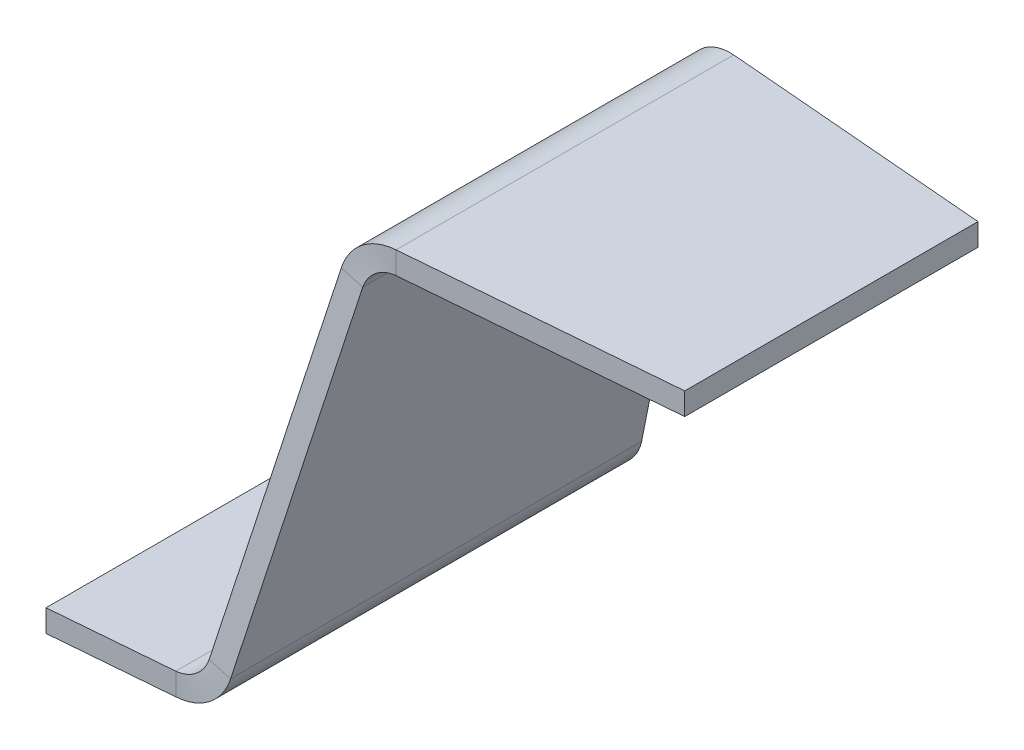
ISO-10303-21;
HEADER;
FILE_DESCRIPTION(('STEP AP214'),'2;1');
FILE_NAME('part.step','',(''),(''),'','','');
FILE_SCHEMA(('AUTOMOTIVE_DESIGN { 1 0 10303 214 1 1 1 1 }'));
ENDSEC;
DATA;
#1=APPLICATION_CONTEXT('core data for automotive mechanical design processes');
#2=APPLICATION_PROTOCOL_DEFINITION('international standard','automotive_design',2000,#1);
#3=PRODUCT_CONTEXT('',#1,'mechanical');
#4=PRODUCT('Part','Part','',(#3));
#5=PRODUCT_RELATED_PRODUCT_CATEGORY('part','',(#4));
#6=PRODUCT_DEFINITION_FORMATION('','',#4);
#7=PRODUCT_DEFINITION_CONTEXT('part definition',#1,'design');
#8=PRODUCT_DEFINITION('design','',#6,#7);
#9=PRODUCT_DEFINITION_SHAPE('','',#8);
#10=(LENGTH_UNIT() NAMED_UNIT(*) SI_UNIT(.MILLI.,.METRE.));
#11=(NAMED_UNIT(*) PLANE_ANGLE_UNIT() SI_UNIT($,.RADIAN.));
#12=(NAMED_UNIT(*) SI_UNIT($,.STERADIAN.) SOLID_ANGLE_UNIT());
#13=UNCERTAINTY_MEASURE_WITH_UNIT(LENGTH_MEASURE(1.E-05),#10,'distance_accuracy_value','');
#14=(GEOMETRIC_REPRESENTATION_CONTEXT(3) GLOBAL_UNCERTAINTY_ASSIGNED_CONTEXT((#13)) GLOBAL_UNIT_ASSIGNED_CONTEXT((#10,
#11,#12)) REPRESENTATION_CONTEXT('',''));
#15=CARTESIAN_POINT('',(0.,0.,0.));
#16=DIRECTION('',(0.,0.,1.));
#17=DIRECTION('',(1.,0.,0.));
#18=AXIS2_PLACEMENT_3D('',#15,#16,#17);
#19=CARTESIAN_POINT('',(21.3546614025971,-21.9803413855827,0.));
#20=DIRECTION('',(0.965925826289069,-0.258819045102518,0.));
#21=DIRECTION('',(0.,0.,-1.));
#22=AXIS2_PLACEMENT_3D('',#19,#20,#21);
#23=PLANE('',#22);
#24=DIRECTION('',(-0.257925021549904,-0.962589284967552,-0.0830454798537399));
#25=VECTOR('',#24,1.);
#26=CARTESIAN_POINT('',(21.3546614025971,-21.9803413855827,-37.5));
#27=LINE('',#26,#25);
#28=CARTESIAN_POINT('',(46.0544058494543,70.2003598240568,-29.5472929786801));
#29=VERTEX_POINT('',#28);
#30=CARTESIAN_POINT('',(29.0072975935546,6.57968569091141,-35.0360403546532));
#31=VERTEX_POINT('',#30);
#32=EDGE_CURVE('E89',#29,#31,#27,.T.);
#33=ORIENTED_EDGE('',*,*,#32,.F.);
#34=DIRECTION('',(0.,0.,1.));
#35=VECTOR('',#34,1.);
#36=CARTESIAN_POINT('',(46.0544058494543,70.2003598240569,0.));
#37=LINE('',#36,#35);
#38=CARTESIAN_POINT('',(46.0544058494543,70.2003598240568,29.5472929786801));
#39=VERTEX_POINT('',#38);
#40=EDGE_CURVE('E82',#29,#39,#37,.T.);
#41=ORIENTED_EDGE('',*,*,#40,.T.);
#42=DIRECTION('',(0.257925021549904,0.962589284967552,-0.08304547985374));
#43=VECTOR('',#42,1.);
#44=CARTESIAN_POINT('',(21.3546614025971,-21.9803413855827,37.5));
#45=LINE('',#44,#43);
#46=CARTESIAN_POINT('',(29.0072975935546,6.57968569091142,35.0360403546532));
#47=VERTEX_POINT('',#46);
#48=EDGE_CURVE('E97',#47,#39,#45,.T.);
#49=ORIENTED_EDGE('',*,*,#48,.F.);
#50=DIRECTION('',(0.,0.,-1.));
#51=VECTOR('',#50,1.);
#52=CARTESIAN_POINT('',(29.0072975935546,6.57968569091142,0.));
#53=LINE('',#52,#51);
#54=EDGE_CURVE('E547',#47,#31,#53,.T.);
#55=ORIENTED_EDGE('',*,*,#54,.T.);
#56=EDGE_LOOP('',(#33,#41,#49,#55));
#57=FACE_BOUND('',#56,.T.);
#58=ADVANCED_FACE('F70',(#57),#23,.T.);
#59=CARTESIAN_POINT('',(17.6867512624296,-20.9975278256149,37.5));
#60=DIRECTION('',(-0.0214937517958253,-0.080215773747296,-0.99654575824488));
#61=DIRECTION('',(-0.257925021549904,-0.962589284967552,0.08304547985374));
#62=AXIS2_PLACEMENT_3D('',#59,#60,#61);
#63=PLANE('',#62);
#64=CARTESIAN_POINT('',(42.3864957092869,71.1831733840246,29.5472929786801));
#65=CARTESIAN_POINT('',(46.0544058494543,70.2003598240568,29.5472929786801));
#66=B_SPLINE_CURVE_WITH_KNOTS('',1,(#64,#65),.UNSPECIFIED.,.F.,.F.,(2,2),(0.,1.),.UNSPECIFIED.);
#67=CARTESIAN_POINT('',(42.3864957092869,71.1831733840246,29.5472929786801));
#68=VERTEX_POINT('',#67);
#69=EDGE_CURVE('E852',#68,#39,#66,.T.);
#70=ORIENTED_EDGE('',*,*,#69,.F.);
#71=DIRECTION('',(0.257925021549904,0.962589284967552,-0.08304547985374));
#72=VECTOR('',#71,1.);
#73=CARTESIAN_POINT('',(17.6867512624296,-20.9975278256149,37.5));
#74=LINE('',#73,#72);
#75=CARTESIAN_POINT('',(25.3393874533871,7.56249925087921,35.0360403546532));
#76=VERTEX_POINT('',#75);
#77=EDGE_CURVE('E515',#76,#68,#74,.T.);
#78=ORIENTED_EDGE('',*,*,#77,.F.);
#79=CARTESIAN_POINT('',(29.0072975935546,6.57968569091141,35.0360403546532));
#80=CARTESIAN_POINT('',(25.3393874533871,7.56249925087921,35.0360403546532));
#81=B_SPLINE_CURVE_WITH_KNOTS('',1,(#79,#80),.UNSPECIFIED.,.F.,.F.,(2,2),(0.,1.),.UNSPECIFIED.);
#82=EDGE_CURVE('E548',#47,#76,#81,.T.);
#83=ORIENTED_EDGE('',*,*,#82,.F.);
#84=ORIENTED_EDGE('',*,*,#48,.T.);
#85=EDGE_LOOP('',(#70,#78,#83,#84));
#86=FACE_BOUND('',#85,.T.);
#87=ADVANCED_FACE('F551',(#86),#63,.F.);
#88=CARTESIAN_POINT('',(17.6867512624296,-20.9975278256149,-37.5));
#89=DIRECTION('',(-0.0214937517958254,-0.080215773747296,0.99654575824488));
#90=DIRECTION('',(0.257925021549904,0.962589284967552,0.0830454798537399));
#91=AXIS2_PLACEMENT_3D('',#88,#89,#90);
#92=PLANE('',#91);
#93=CARTESIAN_POINT('',(46.0544058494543,70.2003598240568,-29.5472929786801));
#94=CARTESIAN_POINT('',(42.3864957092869,71.1831733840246,-29.5472929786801));
#95=B_SPLINE_CURVE_WITH_KNOTS('',1,(#93,#94),.UNSPECIFIED.,.F.,.F.,(2,2),(0.,1.),.UNSPECIFIED.);
#96=CARTESIAN_POINT('',(42.3864957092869,71.1831733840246,-29.5472929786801));
#97=VERTEX_POINT('',#96);
#98=EDGE_CURVE('E12',#29,#97,#95,.T.);
#99=ORIENTED_EDGE('',*,*,#98,.F.);
#100=ORIENTED_EDGE('',*,*,#32,.T.);
#101=CARTESIAN_POINT('',(25.3393874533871,7.56249925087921,-35.0360403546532));
#102=CARTESIAN_POINT('',(29.0072975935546,6.57968569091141,-35.0360403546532));
#103=B_SPLINE_CURVE_WITH_KNOTS('',1,(#101,#102),.UNSPECIFIED.,.F.,.F.,(2,2),(0.,1.),.UNSPECIFIED.);
#104=CARTESIAN_POINT('',(25.3393874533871,7.5624992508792,-35.0360403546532));
#105=VERTEX_POINT('',#104);
#106=EDGE_CURVE('E511',#105,#31,#103,.T.);
#107=ORIENTED_EDGE('',*,*,#106,.F.);
#108=DIRECTION('',(-0.257925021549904,-0.962589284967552,-0.0830454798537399));
#109=VECTOR('',#108,1.);
#110=CARTESIAN_POINT('',(17.6867512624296,-20.9975278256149,-37.5));
#111=LINE('',#110,#109);
#112=EDGE_CURVE('E512',#97,#105,#111,.T.);
#113=ORIENTED_EDGE('',*,*,#112,.F.);
#114=EDGE_LOOP('',(#99,#100,#107,#113));
#115=FACE_BOUND('',#114,.T.);
#116=ADVANCED_FACE('F72',(#115),#92,.F.);
#117=CARTESIAN_POINT('',(17.6867512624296,-20.9975278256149,0.));
#118=DIRECTION('',(0.965925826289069,-0.258819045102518,0.));
#119=DIRECTION('',(0.,0.,-1.));
#120=AXIS2_PLACEMENT_3D('',#117,#118,#119);
#121=PLANE('',#120);
#122=DIRECTION('',(0.,0.,1.));
#123=VECTOR('',#122,1.);
#124=CARTESIAN_POINT('',(42.3864957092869,71.1831733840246,0.));
#125=LINE('',#124,#123);
#126=EDGE_CURVE('E526',#97,#68,#125,.T.);
#127=ORIENTED_EDGE('',*,*,#126,.F.);
#128=ORIENTED_EDGE('',*,*,#112,.T.);
#129=DIRECTION('',(0.,0.,-1.));
#130=VECTOR('',#129,1.);
#131=CARTESIAN_POINT('',(25.3393874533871,7.56249925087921,0.));
#132=LINE('',#131,#130);
#133=EDGE_CURVE('E509',#76,#105,#132,.T.);
#134=ORIENTED_EDGE('',*,*,#133,.F.);
#135=ORIENTED_EDGE('',*,*,#77,.T.);
#136=EDGE_LOOP('',(#127,#128,#134,#135));
#137=FACE_BOUND('',#136,.T.);
#138=ADVANCED_FACE('F492',(#137),#121,.F.);
#139=CARTESIAN_POINT('',(0.,3.7973,37.5));
#140=DIRECTION('',(1.,0.,0.));
#141=DIRECTION('',(0.,0.,-1.));
#142=AXIS2_PLACEMENT_3D('',#139,#140,#141);
#143=PLANE('',#142);
#144=DIRECTION('',(0.,0.,1.));
#145=VECTOR('',#144,1.);
#146=CARTESIAN_POINT('',(0.,0.,37.5));
#147=LINE('',#146,#145);
#148=CARTESIAN_POINT('',(0.,0.,-37.5));
#149=VERTEX_POINT('',#148);
#150=CARTESIAN_POINT('',(0.,0.,37.5));
#151=VERTEX_POINT('',#150);
#152=EDGE_CURVE('E454',#149,#151,#147,.T.);
#153=ORIENTED_EDGE('',*,*,#152,.T.);
#154=DIRECTION('',(0.,-1.,0.));
#155=VECTOR('',#154,1.);
#156=CARTESIAN_POINT('',(0.,3.7973,37.5));
#157=LINE('',#156,#155);
#158=CARTESIAN_POINT('',(0.,3.7973,37.5));
#159=VERTEX_POINT('',#158);
#160=EDGE_CURVE('E439',#159,#151,#157,.T.);
#161=ORIENTED_EDGE('',*,*,#160,.F.);
#162=DIRECTION('',(0.,0.,1.));
#163=VECTOR('',#162,1.);
#164=CARTESIAN_POINT('',(0.,3.7973,37.5));
#165=LINE('',#164,#163);
#166=CARTESIAN_POINT('',(0.,3.7973,-37.5));
#167=VERTEX_POINT('',#166);
#168=EDGE_CURVE('E447',#167,#159,#165,.T.);
#169=ORIENTED_EDGE('',*,*,#168,.F.);
#170=DIRECTION('',(0.,-1.,0.));
#171=VECTOR('',#170,1.);
#172=CARTESIAN_POINT('',(0.,3.7973,-37.5));
#173=LINE('',#172,#171);
#174=EDGE_CURVE('E450',#167,#149,#173,.T.);
#175=ORIENTED_EDGE('',*,*,#174,.T.);
#176=EDGE_LOOP('',(#153,#161,#169,#175));
#177=FACE_BOUND('',#176,.T.);
#178=ADVANCED_FACE('F397',(#177),#143,.F.);
#179=CARTESIAN_POINT('',(0.,3.7973,0.));
#180=DIRECTION('',(0.,-1.,0.));
#181=DIRECTION('',(0.,0.,-1.));
#182=AXIS2_PLACEMENT_3D('',#179,#180,#181);
#183=PLANE('',#182);
#184=DIRECTION('',(0.99654575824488,0.,-0.0830454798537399));
#185=VECTOR('',#184,1.);
#186=CARTESIAN_POINT('',(0.,3.7973,37.5));
#187=LINE('',#186,#185);
#188=CARTESIAN_POINT('',(20.4324842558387,3.7973,35.7972929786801));
#189=VERTEX_POINT('',#188);
#190=EDGE_CURVE('E453',#159,#189,#187,.T.);
#191=ORIENTED_EDGE('',*,*,#190,.T.);
#192=DIRECTION('',(0.,0.,-1.));
#193=VECTOR('',#192,1.);
#194=CARTESIAN_POINT('',(20.4324842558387,3.7973,0.));
#195=LINE('',#194,#193);
#196=CARTESIAN_POINT('',(20.4324842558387,3.7973,-35.7972929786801));
#197=VERTEX_POINT('',#196);
#198=EDGE_CURVE('E472',#189,#197,#195,.T.);
#199=ORIENTED_EDGE('',*,*,#198,.T.);
#200=DIRECTION('',(-0.99654575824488,0.,-0.0830454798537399));
#201=VECTOR('',#200,1.);
#202=CARTESIAN_POINT('',(0.,3.7973,-37.5));
#203=LINE('',#202,#201);
#204=EDGE_CURVE('E449',#197,#167,#203,.T.);
#205=ORIENTED_EDGE('',*,*,#204,.T.);
#206=ORIENTED_EDGE('',*,*,#168,.T.);
#207=EDGE_LOOP('',(#191,#199,#205,#206));
#208=FACE_BOUND('',#207,.T.);
#209=ADVANCED_FACE('F484',(#208),#183,.F.);
#210=CARTESIAN_POINT('',(0.,3.7973,-37.5));
#211=DIRECTION('',(-0.08304547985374,0.,0.99654575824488));
#212=DIRECTION('',(0.99654575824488,0.,0.08304547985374));
#213=AXIS2_PLACEMENT_3D('',#210,#211,#212);
#214=PLANE('',#213);
#215=ORIENTED_EDGE('',*,*,#204,.F.);
#216=CARTESIAN_POINT('',(20.4324842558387,0.,-35.7972929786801));
#217=CARTESIAN_POINT('',(20.4324842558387,3.7973,-35.7972929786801));
#218=B_SPLINE_CURVE_WITH_KNOTS('',1,(#216,#217),.UNSPECIFIED.,.F.,.F.,(2,2),(0.,1.),.UNSPECIFIED.);
#219=CARTESIAN_POINT('',(20.4324842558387,0.,-35.7972929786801));
#220=VERTEX_POINT('',#219);
#221=EDGE_CURVE('E435',#197,#220,#218,.F.);
#222=ORIENTED_EDGE('',*,*,#221,.T.);
#223=DIRECTION('',(-0.99654575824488,0.,-0.0830454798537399));
#224=VECTOR('',#223,1.);
#225=CARTESIAN_POINT('',(0.,0.,-37.5));
#226=LINE('',#225,#224);
#227=EDGE_CURVE('E460',#220,#149,#226,.T.);
#228=ORIENTED_EDGE('',*,*,#227,.T.);
#229=ORIENTED_EDGE('',*,*,#174,.F.);
#230=EDGE_LOOP('',(#215,#222,#228,#229));
#231=FACE_BOUND('',#230,.T.);
#232=ADVANCED_FACE('F474',(#231),#214,.F.);
#233=CARTESIAN_POINT('',(0.,0.,0.));
#234=DIRECTION('',(0.,-1.,0.));
#235=DIRECTION('',(0.,0.,-1.));
#236=AXIS2_PLACEMENT_3D('',#233,#234,#235);
#237=PLANE('',#236);
#238=DIRECTION('',(0.,0.,-1.));
#239=VECTOR('',#238,1.);
#240=CARTESIAN_POINT('',(20.4324842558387,0.,0.));
#241=LINE('',#240,#239);
#242=CARTESIAN_POINT('',(20.4324842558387,0.,35.7972929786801));
#243=VERTEX_POINT('',#242);
#244=EDGE_CURVE('E456',#243,#220,#241,.T.);
#245=ORIENTED_EDGE('',*,*,#244,.F.);
#246=DIRECTION('',(0.99654575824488,0.,-0.0830454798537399));
#247=VECTOR('',#246,1.);
#248=CARTESIAN_POINT('',(0.,0.,37.5));
#249=LINE('',#248,#247);
#250=EDGE_CURVE('E462',#151,#243,#249,.T.);
#251=ORIENTED_EDGE('',*,*,#250,.F.);
#252=ORIENTED_EDGE('',*,*,#152,.F.);
#253=ORIENTED_EDGE('',*,*,#227,.F.);
#254=EDGE_LOOP('',(#245,#251,#252,#253));
#255=FACE_BOUND('',#254,.T.);
#256=ADVANCED_FACE('F483',(#255),#237,.T.);
#257=CARTESIAN_POINT('',(0.,3.7973,37.5));
#258=DIRECTION('',(-0.08304547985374,0.,-0.99654575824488));
#259=DIRECTION('',(-0.99654575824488,0.,0.08304547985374));
#260=AXIS2_PLACEMENT_3D('',#257,#258,#259);
#261=PLANE('',#260);
#262=ORIENTED_EDGE('',*,*,#250,.T.);
#263=CARTESIAN_POINT('',(20.4324842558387,3.7973,35.7972929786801));
#264=CARTESIAN_POINT('',(20.4324842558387,0.,35.7972929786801));
#265=B_SPLINE_CURVE_WITH_KNOTS('',1,(#263,#264),.UNSPECIFIED.,.F.,.F.,(2,2),(0.,1.),.UNSPECIFIED.);
#266=EDGE_CURVE('E423',#243,#189,#265,.F.);
#267=ORIENTED_EDGE('',*,*,#266,.T.);
#268=ORIENTED_EDGE('',*,*,#190,.F.);
#269=ORIENTED_EDGE('',*,*,#160,.T.);
#270=EDGE_LOOP('',(#262,#267,#268,#269));
#271=FACE_BOUND('',#270,.T.);
#272=ADVANCED_FACE('F396',(#271),#261,.F.);
#273=CARTESIAN_POINT('',(20.4324842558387,0.,35.7972929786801));
#274=CARTESIAN_POINT('',(21.4009315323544,0.,35.7338497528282));
#275=CARTESIAN_POINT('',(22.3690265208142,0.159847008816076,35.6704175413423));
#276=CARTESIAN_POINT('',(24.2029711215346,0.782387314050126,35.5435421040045));
#277=CARTESIAN_POINT('',(25.0683879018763,1.24496222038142,35.4801043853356));
#278=CARTESIAN_POINT('',(26.6048962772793,2.42396656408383,35.3532289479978));
#279=CARTESIAN_POINT('',(27.2756956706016,3.14017178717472,35.2897912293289));
#280=CARTESIAN_POINT('',(28.3516832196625,4.75050095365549,35.162915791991));
#281=CARTESIAN_POINT('',(28.7566449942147,5.64423745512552,35.0994835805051));
#282=CARTESIAN_POINT('',(29.0072975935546,6.57968569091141,35.0360403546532));
#283=CARTESIAN_POINT('',(20.4324842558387,3.7973,35.7972929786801));
#284=CARTESIAN_POINT('',(20.9866739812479,3.7973,35.73384980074));
#285=CARTESIAN_POINT('',(21.5406629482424,3.88877182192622,35.6704175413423));
#286=CARTESIAN_POINT('',(22.590130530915,4.2450180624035,35.5435421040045));
#287=CARTESIAN_POINT('',(23.08536187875,4.50972473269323,35.4801043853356));
#288=CARTESIAN_POINT('',(23.9646227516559,5.18440532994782,35.3532289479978));
#289=CARTESIAN_POINT('',(24.3484850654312,5.59425095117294,35.2897912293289));
#290=CARTESIAN_POINT('',(24.96421470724,6.51575548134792,35.162915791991));
#291=CARTESIAN_POINT('',(25.1959525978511,7.02719308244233,35.0994835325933));
#292=CARTESIAN_POINT('',(25.3393874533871,7.56249925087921,35.0360403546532));
#293=B_SPLINE_SURFACE_WITH_KNOTS('',1,3,((#273,#274,#275,#276,#277,#278,#279,#280,#281,#282),
(#283,#284,#285,#286,#287,#288,#289,#290,#291,#292)),.UNSPECIFIED.,.F.,.F.,.F.,(2,2),(4,2,2,2,
4),(0.,1.),(0.,0.25,0.5,0.75,1.),.UNSPECIFIED.);
#294=CARTESIAN_POINT('',(20.4324842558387,0.,35.7972929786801));
#295=CARTESIAN_POINT('',(21.4009315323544,0.,35.7338497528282));
#296=CARTESIAN_POINT('',(22.3690265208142,0.159847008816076,35.6704175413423));
#297=CARTESIAN_POINT('',(24.2029711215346,0.782387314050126,35.5435421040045));
#298=CARTESIAN_POINT('',(25.0683879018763,1.24496222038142,35.4801043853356));
#299=CARTESIAN_POINT('',(26.6048962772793,2.42396656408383,35.3532289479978));
#300=CARTESIAN_POINT('',(27.2756956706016,3.14017178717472,35.2897912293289));
#301=CARTESIAN_POINT('',(28.3516832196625,4.75050095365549,35.162915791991));
#302=CARTESIAN_POINT('',(28.7566449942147,5.64423745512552,35.0994835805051));
#303=CARTESIAN_POINT('',(29.0072975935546,6.57968569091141,35.0360403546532));
#304=B_SPLINE_CURVE_WITH_KNOTS('',3,(#294,#295,#296,#297,#298,#299,#300,#301,#302,#303),
.UNSPECIFIED.,.F.,.F.,(4,2,2,2,4),(0.,0.25,0.5,0.75,1.),.UNSPECIFIED.);
#305=EDGE_CURVE('E805',#243,#47,#304,.T.);
#306=CARTESIAN_POINT('',(25.3393874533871,7.56249925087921,35.0360403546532));
#307=CARTESIAN_POINT('',(25.1959525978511,7.02719308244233,35.0994835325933));
#308=CARTESIAN_POINT('',(24.96421470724,6.51575548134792,35.162915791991));
#309=CARTESIAN_POINT('',(24.3484850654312,5.59425095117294,35.2897912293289));
#310=CARTESIAN_POINT('',(23.9646227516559,5.18440532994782,35.3532289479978));
#311=CARTESIAN_POINT('',(23.08536187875,4.50972473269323,35.4801043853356));
#312=CARTESIAN_POINT('',(22.590130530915,4.2450180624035,35.5435421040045));
#313=CARTESIAN_POINT('',(21.5406629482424,3.88877182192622,35.6704175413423));
#314=CARTESIAN_POINT('',(20.9866739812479,3.7973,35.73384980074));
#315=CARTESIAN_POINT('',(20.4324842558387,3.7973,35.7972929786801));
#316=B_SPLINE_CURVE_WITH_KNOTS('',3,(#306,#307,#308,#309,#310,#311,#312,#313,#314,#315),
.UNSPECIFIED.,.F.,.F.,(4,2,2,2,4),(0.,0.25,0.5,0.75,1.),.UNSPECIFIED.);
#317=EDGE_CURVE('E379',#189,#76,#316,.F.);
#318=ORIENTED_EDGE('',*,*,#266,.F.);
#319=ORIENTED_EDGE('',*,*,#305,.T.);
#320=ORIENTED_EDGE('',*,*,#82,.T.);
#321=ORIENTED_EDGE('',*,*,#317,.F.);
#322=EDGE_LOOP('',(#318,#319,#320,#321));
#323=FACE_BOUND('',#322,.T.);
#324=ADVANCED_FACE('F385',(#323),#293,.F.);
#325=CARTESIAN_POINT('',(29.0072975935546,6.57968569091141,-35.0360403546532));
#326=CARTESIAN_POINT('',(28.7566449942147,5.64423745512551,-35.0994835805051));
#327=CARTESIAN_POINT('',(28.3516832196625,4.75050095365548,-35.162915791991));
#328=CARTESIAN_POINT('',(27.2756956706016,3.14017178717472,-35.2897912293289));
#329=CARTESIAN_POINT('',(26.6048962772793,2.42396656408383,-35.3532289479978));
#330=CARTESIAN_POINT('',(25.0683879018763,1.24496222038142,-35.4801043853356));
#331=CARTESIAN_POINT('',(24.2029711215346,0.782387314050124,-35.5435421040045));
#332=CARTESIAN_POINT('',(22.3690265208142,0.159847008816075,-35.6704175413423));
#333=CARTESIAN_POINT('',(21.4009315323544,0.,-35.7338497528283));
#334=CARTESIAN_POINT('',(20.4324842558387,0.,-35.7972929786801));
#335=CARTESIAN_POINT('',(25.3393874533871,7.56249925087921,-35.0360403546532));
#336=CARTESIAN_POINT('',(25.1959525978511,7.02719308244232,-35.0994835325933));
#337=CARTESIAN_POINT('',(24.96421470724,6.51575548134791,-35.162915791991));
#338=CARTESIAN_POINT('',(24.3484850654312,5.59425095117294,-35.2897912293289));
#339=CARTESIAN_POINT('',(23.9646227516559,5.18440532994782,-35.3532289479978));
#340=CARTESIAN_POINT('',(23.08536187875,4.50972473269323,-35.4801043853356));
#341=CARTESIAN_POINT('',(22.590130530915,4.2450180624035,-35.5435421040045));
#342=CARTESIAN_POINT('',(21.5406629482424,3.88877182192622,-35.6704175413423));
#343=CARTESIAN_POINT('',(20.986673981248,3.7973,-35.73384980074));
#344=CARTESIAN_POINT('',(20.4324842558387,3.7973,-35.7972929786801));
#345=B_SPLINE_SURFACE_WITH_KNOTS('',1,3,((#325,#326,#327,#328,#329,#330,#331,#332,#333,#334),
(#335,#336,#337,#338,#339,#340,#341,#342,#343,#344)),.UNSPECIFIED.,.F.,.F.,.F.,(2,2),(4,2,2,2,
4),(0.,1.),(0.,0.25,0.5,0.75,1.),.UNSPECIFIED.);
#346=CARTESIAN_POINT('',(29.0072975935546,6.57968569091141,-35.0360403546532));
#347=CARTESIAN_POINT('',(28.7566449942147,5.64423745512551,-35.0994835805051));
#348=CARTESIAN_POINT('',(28.3516832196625,4.75050095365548,-35.162915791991));
#349=CARTESIAN_POINT('',(27.2756956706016,3.14017178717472,-35.2897912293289));
#350=CARTESIAN_POINT('',(26.6048962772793,2.42396656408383,-35.3532289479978));
#351=CARTESIAN_POINT('',(25.0683879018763,1.24496222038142,-35.4801043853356));
#352=CARTESIAN_POINT('',(24.2029711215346,0.782387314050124,-35.5435421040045));
#353=CARTESIAN_POINT('',(22.3690265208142,0.159847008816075,-35.6704175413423));
#354=CARTESIAN_POINT('',(21.4009315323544,0.,-35.7338497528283));
#355=CARTESIAN_POINT('',(20.4324842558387,0.,-35.7972929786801));
#356=B_SPLINE_CURVE_WITH_KNOTS('',3,(#346,#347,#348,#349,#350,#351,#352,#353,#354,#355),
.UNSPECIFIED.,.F.,.F.,(4,2,2,2,4),(0.,0.25,0.5,0.75,1.),.UNSPECIFIED.);
#357=EDGE_CURVE('E344',#31,#220,#356,.T.);
#358=CARTESIAN_POINT('',(20.4324842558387,3.7973,-35.7972929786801));
#359=CARTESIAN_POINT('',(20.986673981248,3.7973,-35.73384980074));
#360=CARTESIAN_POINT('',(21.5406629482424,3.88877182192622,-35.6704175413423));
#361=CARTESIAN_POINT('',(22.590130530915,4.2450180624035,-35.5435421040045));
#362=CARTESIAN_POINT('',(23.08536187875,4.50972473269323,-35.4801043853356));
#363=CARTESIAN_POINT('',(23.9646227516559,5.18440532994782,-35.3532289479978));
#364=CARTESIAN_POINT('',(24.3484850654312,5.59425095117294,-35.2897912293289));
#365=CARTESIAN_POINT('',(24.96421470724,6.51575548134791,-35.162915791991));
#366=CARTESIAN_POINT('',(25.1959525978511,7.02719308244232,-35.0994835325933));
#367=CARTESIAN_POINT('',(25.3393874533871,7.56249925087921,-35.0360403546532));
#368=B_SPLINE_CURVE_WITH_KNOTS('',3,(#358,#359,#360,#361,#362,#363,#364,#365,#366,#367),
.UNSPECIFIED.,.F.,.F.,(4,2,2,2,4),(0.,0.25,0.5,0.75,1.),.UNSPECIFIED.);
#369=EDGE_CURVE('E337',#105,#197,#368,.F.);
#370=ORIENTED_EDGE('',*,*,#106,.T.);
#371=ORIENTED_EDGE('',*,*,#357,.T.);
#372=ORIENTED_EDGE('',*,*,#221,.F.);
#373=ORIENTED_EDGE('',*,*,#369,.F.);
#374=EDGE_LOOP('',(#370,#371,#372,#373));
#375=FACE_BOUND('',#374,.T.);
#376=ADVANCED_FACE('F357',(#375),#345,.F.);
#377=CARTESIAN_POINT('',(20.4324842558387,8.8773,72.2748436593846));
#378=DIRECTION('',(0.,0.,-1.));
#379=DIRECTION('',(-1.,0.,0.));
#380=AXIS2_PLACEMENT_3D('',#377,#378,#379);
#381=CYLINDRICAL_SURFACE('',#380,5.08);
#382=ORIENTED_EDGE('',*,*,#369,.T.);
#383=ORIENTED_EDGE('',*,*,#198,.F.);
#384=ORIENTED_EDGE('',*,*,#317,.T.);
#385=ORIENTED_EDGE('',*,*,#133,.T.);
#386=EDGE_LOOP('',(#382,#383,#384,#385));
#387=FACE_BOUND('',#386,.T.);
#388=ADVANCED_FACE('F276',(#387),#381,.F.);
#389=CARTESIAN_POINT('',(20.4324842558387,8.8773,72.2748436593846));
#390=DIRECTION('',(0.,0.,-1.));
#391=DIRECTION('',(-1.,0.,0.));
#392=AXIS2_PLACEMENT_3D('',#389,#390,#391);
#393=CYLINDRICAL_SURFACE('',#392,8.8773);
#394=ORIENTED_EDGE('',*,*,#357,.F.);
#395=ORIENTED_EDGE('',*,*,#54,.F.);
#396=ORIENTED_EDGE('',*,*,#305,.F.);
#397=ORIENTED_EDGE('',*,*,#244,.T.);
#398=EDGE_LOOP('',(#394,#395,#396,#397));
#399=FACE_BOUND('',#398,.T.);
#400=ADVANCED_FACE('F272',(#399),#393,.T.);
#401=CARTESIAN_POINT('',(50.9613090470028,77.7628590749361,-28.7860403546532));
#402=CARTESIAN_POINT('',(49.992861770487,77.7628590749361,-28.8494835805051));
#403=CARTESIAN_POINT('',(49.0247667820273,77.60301206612,-28.912915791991));
#404=CARTESIAN_POINT('',(47.1908221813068,76.9804717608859,-29.0397912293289));
#405=CARTESIAN_POINT('',(46.3254054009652,76.5178968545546,-29.1032289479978));
#406=CARTESIAN_POINT('',(44.7888970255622,75.3388925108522,-29.2301043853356));
#407=CARTESIAN_POINT('',(44.1180976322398,74.6226872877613,-29.2935421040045));
#408=CARTESIAN_POINT('',(43.042110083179,73.0123581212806,-29.4204175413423));
#409=CARTESIAN_POINT('',(42.6371483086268,72.1186216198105,-29.4838497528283));
#410=CARTESIAN_POINT('',(42.3864957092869,71.1831733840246,-29.5472929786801));
#411=CARTESIAN_POINT('',(50.9613090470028,73.9655590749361,-28.7860403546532));
#412=CARTESIAN_POINT('',(50.4071193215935,73.9655590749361,-28.8494835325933));
#413=CARTESIAN_POINT('',(49.8531303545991,73.8740872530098,-28.912915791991));
#414=CARTESIAN_POINT('',(48.8036627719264,73.5178410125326,-29.0397912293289));
#415=CARTESIAN_POINT('',(48.3084314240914,73.2531343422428,-29.1032289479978));
#416=CARTESIAN_POINT('',(47.4291705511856,72.5784537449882,-29.2301043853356));
#417=CARTESIAN_POINT('',(47.0453082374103,72.1686081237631,-29.2935421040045));
#418=CARTESIAN_POINT('',(46.4295785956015,71.2471035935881,-29.4204175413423));
#419=CARTESIAN_POINT('',(46.1978407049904,70.7356659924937,-29.48384980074));
#420=CARTESIAN_POINT('',(46.0544058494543,70.2003598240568,-29.5472929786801));
#421=B_SPLINE_SURFACE_WITH_KNOTS('',1,3,((#401,#402,#403,#404,#405,#406,#407,#408,#409,#410),
(#411,#412,#413,#414,#415,#416,#417,#418,#419,#420)),.UNSPECIFIED.,.F.,.F.,.F.,(2,2),(4,2,2,2,
4),(0.,1.),(0.,0.25,0.5,0.75,1.),.UNSPECIFIED.);
#422=CARTESIAN_POINT('',(50.9613090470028,77.7628590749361,-28.7860403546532));
#423=CARTESIAN_POINT('',(50.9613090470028,73.9655590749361,-28.7860403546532));
#424=B_SPLINE_CURVE_WITH_KNOTS('',1,(#422,#423),.UNSPECIFIED.,.F.,.F.,(2,2),(0.,1.),.UNSPECIFIED.);
#425=CARTESIAN_POINT('',(50.9613090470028,73.9655590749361,-28.7860403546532));
#426=VERTEX_POINT('',#425);
#427=CARTESIAN_POINT('',(50.9613090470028,77.7628590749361,-28.7860403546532));
#428=VERTEX_POINT('',#427);
#429=EDGE_CURVE('E303',#426,#428,#424,.F.);
#430=CARTESIAN_POINT('',(50.9613090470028,73.9655590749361,-28.7860403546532));
#431=CARTESIAN_POINT('',(50.4071193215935,73.9655590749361,-28.8494835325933));
#432=CARTESIAN_POINT('',(49.8531303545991,73.8740872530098,-28.912915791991));
#433=CARTESIAN_POINT('',(48.8036627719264,73.5178410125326,-29.0397912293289));
#434=CARTESIAN_POINT('',(48.3084314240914,73.2531343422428,-29.1032289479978));
#435=CARTESIAN_POINT('',(47.4291705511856,72.5784537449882,-29.2301043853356));
#436=CARTESIAN_POINT('',(47.0453082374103,72.1686081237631,-29.2935421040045));
#437=CARTESIAN_POINT('',(46.4295785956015,71.2471035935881,-29.4204175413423));
#438=CARTESIAN_POINT('',(46.1978407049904,70.7356659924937,-29.48384980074));
#439=CARTESIAN_POINT('',(46.0544058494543,70.2003598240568,-29.5472929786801));
#440=B_SPLINE_CURVE_WITH_KNOTS('',3,(#430,#431,#432,#433,#434,#435,#436,#437,#438,#439),
.UNSPECIFIED.,.F.,.F.,(4,2,2,2,4),(0.,0.25,0.5,0.75,1.),.UNSPECIFIED.);
#441=EDGE_CURVE('E244',#426,#29,#440,.T.);
#442=CARTESIAN_POINT('',(42.3864957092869,71.1831733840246,-29.5472929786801));
#443=CARTESIAN_POINT('',(42.6371483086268,72.1186216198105,-29.4838497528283));
#444=CARTESIAN_POINT('',(43.042110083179,73.0123581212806,-29.4204175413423));
#445=CARTESIAN_POINT('',(44.1180976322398,74.6226872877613,-29.2935421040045));
#446=CARTESIAN_POINT('',(44.7888970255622,75.3388925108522,-29.2301043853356));
#447=CARTESIAN_POINT('',(46.3254054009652,76.5178968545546,-29.1032289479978));
#448=CARTESIAN_POINT('',(47.1908221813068,76.9804717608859,-29.0397912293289));
#449=CARTESIAN_POINT('',(49.0247667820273,77.60301206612,-28.912915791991));
#450=CARTESIAN_POINT('',(49.992861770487,77.7628590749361,-28.8494835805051));
#451=CARTESIAN_POINT('',(50.9613090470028,77.7628590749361,-28.7860403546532));
#452=B_SPLINE_CURVE_WITH_KNOTS('',3,(#442,#443,#444,#445,#446,#447,#448,#449,#450,#451),
.UNSPECIFIED.,.F.,.F.,(4,2,2,2,4),(0.,0.25,0.5,0.75,1.),.UNSPECIFIED.);
#453=EDGE_CURVE('E237',#428,#97,#452,.F.);
#454=ORIENTED_EDGE('',*,*,#429,.F.);
#455=ORIENTED_EDGE('',*,*,#441,.T.);
#456=ORIENTED_EDGE('',*,*,#98,.T.);
#457=ORIENTED_EDGE('',*,*,#453,.F.);
#458=EDGE_LOOP('',(#454,#455,#456,#457));
#459=FACE_BOUND('',#458,.T.);
#460=ADVANCED_FACE('F261',(#459),#421,.T.);
#461=CARTESIAN_POINT('',(42.3864957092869,71.1831733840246,29.5472929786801));
#462=CARTESIAN_POINT('',(42.6371483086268,72.1186216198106,29.4838497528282));
#463=CARTESIAN_POINT('',(43.042110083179,73.0123581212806,29.4204175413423));
#464=CARTESIAN_POINT('',(44.1180976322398,74.6226872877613,29.2935421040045));
#465=CARTESIAN_POINT('',(44.7888970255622,75.3388925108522,29.2301043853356));
#466=CARTESIAN_POINT('',(46.3254054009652,76.5178968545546,29.1032289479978));
#467=CARTESIAN_POINT('',(47.1908221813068,76.9804717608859,29.0397912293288));
#468=CARTESIAN_POINT('',(49.0247667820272,77.60301206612,28.912915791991));
#469=CARTESIAN_POINT('',(49.992861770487,77.7628590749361,28.8494835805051));
#470=CARTESIAN_POINT('',(50.9613090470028,77.7628590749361,28.7860403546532));
#471=CARTESIAN_POINT('',(46.0544058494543,70.2003598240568,29.5472929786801));
#472=CARTESIAN_POINT('',(46.1978407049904,70.7356659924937,29.48384980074));
#473=CARTESIAN_POINT('',(46.4295785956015,71.2471035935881,29.4204175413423));
#474=CARTESIAN_POINT('',(47.0453082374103,72.1686081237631,29.2935421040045));
#475=CARTESIAN_POINT('',(47.4291705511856,72.5784537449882,29.2301043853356));
#476=CARTESIAN_POINT('',(48.3084314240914,73.2531343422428,29.1032289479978));
#477=CARTESIAN_POINT('',(48.8036627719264,73.5178410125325,29.0397912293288));
#478=CARTESIAN_POINT('',(49.8531303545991,73.8740872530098,28.912915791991));
#479=CARTESIAN_POINT('',(50.4071193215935,73.9655590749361,28.8494835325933));
#480=CARTESIAN_POINT('',(50.9613090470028,73.9655590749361,28.7860403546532));
#481=B_SPLINE_SURFACE_WITH_KNOTS('',1,3,((#461,#462,#463,#464,#465,#466,#467,#468,#469,#470),
(#471,#472,#473,#474,#475,#476,#477,#478,#479,#480)),.UNSPECIFIED.,.F.,.F.,.F.,(2,2),(4,2,2,2,
4),(0.,1.),(0.,0.25,0.5,0.75,1.),.UNSPECIFIED.);
#482=CARTESIAN_POINT('',(46.0544058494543,70.2003598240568,29.5472929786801));
#483=CARTESIAN_POINT('',(46.1978407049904,70.7356659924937,29.48384980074));
#484=CARTESIAN_POINT('',(46.4295785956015,71.2471035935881,29.4204175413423));
#485=CARTESIAN_POINT('',(47.0453082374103,72.1686081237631,29.2935421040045));
#486=CARTESIAN_POINT('',(47.4291705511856,72.5784537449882,29.2301043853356));
#487=CARTESIAN_POINT('',(48.3084314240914,73.2531343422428,29.1032289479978));
#488=CARTESIAN_POINT('',(48.8036627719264,73.5178410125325,29.0397912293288));
#489=CARTESIAN_POINT('',(49.8531303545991,73.8740872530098,28.912915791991));
#490=CARTESIAN_POINT('',(50.4071193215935,73.9655590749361,28.8494835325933));
#491=CARTESIAN_POINT('',(50.9613090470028,73.9655590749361,28.7860403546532));
#492=B_SPLINE_CURVE_WITH_KNOTS('',3,(#482,#483,#484,#485,#486,#487,#488,#489,#490,#491),
.UNSPECIFIED.,.F.,.F.,(4,2,2,2,4),(0.,0.25,0.5,0.75,1.),.UNSPECIFIED.);
#493=CARTESIAN_POINT('',(50.9613090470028,73.9655590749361,28.7860403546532));
#494=VERTEX_POINT('',#493);
#495=EDGE_CURVE('E798',#39,#494,#492,.T.);
#496=CARTESIAN_POINT('',(50.9613090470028,73.9655590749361,28.7860403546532));
#497=CARTESIAN_POINT('',(50.9613090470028,77.7628590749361,28.7860403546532));
#498=B_SPLINE_CURVE_WITH_KNOTS('',1,(#496,#497),.UNSPECIFIED.,.F.,.F.,(2,2),(0.,1.),.UNSPECIFIED.);
#499=CARTESIAN_POINT('',(50.9613090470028,77.7628590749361,28.7860403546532));
#500=VERTEX_POINT('',#499);
#501=EDGE_CURVE('E170',#500,#494,#498,.F.);
#502=CARTESIAN_POINT('',(50.9613090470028,77.7628590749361,28.7860403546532));
#503=CARTESIAN_POINT('',(49.992861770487,77.7628590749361,28.8494835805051));
#504=CARTESIAN_POINT('',(49.0247667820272,77.60301206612,28.912915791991));
#505=CARTESIAN_POINT('',(47.1908221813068,76.9804717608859,29.0397912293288));
#506=CARTESIAN_POINT('',(46.3254054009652,76.5178968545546,29.1032289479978));
#507=CARTESIAN_POINT('',(44.7888970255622,75.3388925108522,29.2301043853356));
#508=CARTESIAN_POINT('',(44.1180976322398,74.6226872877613,29.2935421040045));
#509=CARTESIAN_POINT('',(43.042110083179,73.0123581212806,29.4204175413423));
#510=CARTESIAN_POINT('',(42.6371483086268,72.1186216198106,29.4838497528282));
#511=CARTESIAN_POINT('',(42.3864957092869,71.1831733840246,29.5472929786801));
#512=B_SPLINE_CURVE_WITH_KNOTS('',3,(#502,#503,#504,#505,#506,#507,#508,#509,#510,#511),
.UNSPECIFIED.,.F.,.F.,(4,2,2,2,4),(0.,0.25,0.5,0.75,1.),.UNSPECIFIED.);
#513=EDGE_CURVE('E802',#68,#500,#512,.F.);
#514=ORIENTED_EDGE('',*,*,#69,.T.);
#515=ORIENTED_EDGE('',*,*,#495,.T.);
#516=ORIENTED_EDGE('',*,*,#501,.F.);
#517=ORIENTED_EDGE('',*,*,#513,.F.);
#518=EDGE_LOOP('',(#514,#515,#516,#517));
#519=FACE_BOUND('',#518,.T.);
#520=ADVANCED_FACE('F211',(#519),#481,.T.);
#521=CARTESIAN_POINT('',(50.9613090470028,68.8855590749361,60.2057043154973));
#522=DIRECTION('',(0.,0.,-1.));
#523=DIRECTION('',(-1.,0.,0.));
#524=AXIS2_PLACEMENT_3D('',#521,#522,#523);
#525=CYLINDRICAL_SURFACE('',#524,8.8773);
#526=ORIENTED_EDGE('',*,*,#513,.T.);
#527=DIRECTION('',(0.,0.,1.));
#528=VECTOR('',#527,1.);
#529=CARTESIAN_POINT('',(50.9613090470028,77.7628590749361,0.));
#530=LINE('',#529,#528);
#531=EDGE_CURVE('E190',#428,#500,#530,.T.);
#532=ORIENTED_EDGE('',*,*,#531,.F.);
#533=ORIENTED_EDGE('',*,*,#453,.T.);
#534=ORIENTED_EDGE('',*,*,#126,.T.);
#535=EDGE_LOOP('',(#526,#532,#533,#534));
#536=FACE_BOUND('',#535,.T.);
#537=ADVANCED_FACE('F201',(#536),#525,.T.);
#538=CARTESIAN_POINT('',(50.9613090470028,68.8855590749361,60.2057043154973));
#539=DIRECTION('',(0.,0.,-1.));
#540=DIRECTION('',(-1.,0.,0.));
#541=AXIS2_PLACEMENT_3D('',#538,#539,#540);
#542=CYLINDRICAL_SURFACE('',#541,5.08);
#543=ORIENTED_EDGE('',*,*,#495,.F.);
#544=ORIENTED_EDGE('',*,*,#40,.F.);
#545=ORIENTED_EDGE('',*,*,#441,.F.);
#546=DIRECTION('',(0.,0.,1.));
#547=VECTOR('',#546,1.);
#548=CARTESIAN_POINT('',(50.9613090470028,73.9655590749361,0.));
#549=LINE('',#548,#547);
#550=EDGE_CURVE('E183',#426,#494,#549,.T.);
#551=ORIENTED_EDGE('',*,*,#550,.T.);
#552=EDGE_LOOP('',(#543,#544,#545,#551));
#553=FACE_BOUND('',#552,.T.);
#554=ADVANCED_FACE('F210',(#553),#542,.F.);
#555=CARTESIAN_POINT('',(96.3937933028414,77.7628590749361,-25.));
#556=DIRECTION('',(-1.,0.,0.));
#557=DIRECTION('',(0.,0.,1.));
#558=AXIS2_PLACEMENT_3D('',#555,#556,#557);
#559=PLANE('',#558);
#560=DIRECTION('',(0.,0.,-1.));
#561=VECTOR('',#560,1.);
#562=CARTESIAN_POINT('',(96.3937933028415,73.9655590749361,-25.));
#563=LINE('',#562,#561);
#564=CARTESIAN_POINT('',(96.3937933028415,73.9655590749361,25.));
#565=VERTEX_POINT('',#564);
#566=CARTESIAN_POINT('',(96.3937933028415,73.9655590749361,-25.));
#567=VERTEX_POINT('',#566);
#568=EDGE_CURVE('E178',#565,#567,#563,.T.);
#569=ORIENTED_EDGE('',*,*,#568,.T.);
#570=DIRECTION('',(0.,-1.,0.));
#571=VECTOR('',#570,1.);
#572=CARTESIAN_POINT('',(96.3937933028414,77.7628590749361,-25.));
#573=LINE('',#572,#571);
#574=CARTESIAN_POINT('',(96.3937933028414,77.7628590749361,-25.));
#575=VERTEX_POINT('',#574);
#576=EDGE_CURVE('E786',#575,#567,#573,.T.);
#577=ORIENTED_EDGE('',*,*,#576,.F.);
#578=DIRECTION('',(0.,0.,-1.));
#579=VECTOR('',#578,1.);
#580=CARTESIAN_POINT('',(96.3937933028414,77.7628590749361,-25.));
#581=LINE('',#580,#579);
#582=CARTESIAN_POINT('',(96.3937933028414,77.7628590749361,25.));
#583=VERTEX_POINT('',#582);
#584=EDGE_CURVE('E187',#583,#575,#581,.T.);
#585=ORIENTED_EDGE('',*,*,#584,.F.);
#586=DIRECTION('',(0.,-1.,0.));
#587=VECTOR('',#586,1.);
#588=CARTESIAN_POINT('',(96.3937933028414,77.7628590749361,25.));
#589=LINE('',#588,#587);
#590=EDGE_CURVE('E168',#583,#565,#589,.T.);
#591=ORIENTED_EDGE('',*,*,#590,.T.);
#592=EDGE_LOOP('',(#569,#577,#585,#591));
#593=FACE_BOUND('',#592,.T.);
#594=ADVANCED_FACE('F186',(#593),#559,.F.);
#595=CARTESIAN_POINT('',(-53.6062066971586,77.7628590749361,0.));
#596=DIRECTION('',(0.,-1.,0.));
#597=DIRECTION('',(0.,0.,-1.));
#598=AXIS2_PLACEMENT_3D('',#595,#596,#597);
#599=PLANE('',#598);
#600=DIRECTION('',(-0.99654575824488,0.,-0.0830454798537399));
#601=VECTOR('',#600,1.);
#602=CARTESIAN_POINT('',(-53.6062066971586,77.7628590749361,-37.5));
#603=LINE('',#602,#601);
#604=EDGE_CURVE('E188',#575,#428,#603,.T.);
#605=ORIENTED_EDGE('',*,*,#604,.T.);
#606=ORIENTED_EDGE('',*,*,#531,.T.);
#607=DIRECTION('',(0.99654575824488,0.,-0.0830454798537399));
#608=VECTOR('',#607,1.);
#609=CARTESIAN_POINT('',(-53.6062066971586,77.7628590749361,37.5));
#610=LINE('',#609,#608);
#611=EDGE_CURVE('E573',#500,#583,#610,.T.);
#612=ORIENTED_EDGE('',*,*,#611,.T.);
#613=ORIENTED_EDGE('',*,*,#584,.T.);
#614=EDGE_LOOP('',(#605,#606,#612,#613));
#615=FACE_BOUND('',#614,.T.);
#616=ADVANCED_FACE('F589',(#615),#599,.F.);
#617=CARTESIAN_POINT('',(-53.6062066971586,77.7628590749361,37.5));
#618=DIRECTION('',(-0.08304547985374,0.,-0.99654575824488));
#619=DIRECTION('',(-0.99654575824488,0.,0.08304547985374));
#620=AXIS2_PLACEMENT_3D('',#617,#618,#619);
#621=PLANE('',#620);
#622=ORIENTED_EDGE('',*,*,#611,.F.);
#623=ORIENTED_EDGE('',*,*,#501,.T.);
#624=DIRECTION('',(0.99654575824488,0.,-0.0830454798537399));
#625=VECTOR('',#624,1.);
#626=CARTESIAN_POINT('',(-53.6062066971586,73.9655590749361,37.5));
#627=LINE('',#626,#625);
#628=EDGE_CURVE('E164',#494,#565,#627,.T.);
#629=ORIENTED_EDGE('',*,*,#628,.T.);
#630=ORIENTED_EDGE('',*,*,#590,.F.);
#631=EDGE_LOOP('',(#622,#623,#629,#630));
#632=FACE_BOUND('',#631,.T.);
#633=ADVANCED_FACE('F166',(#632),#621,.F.);
#634=CARTESIAN_POINT('',(-53.6062066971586,73.9655590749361,0.));
#635=DIRECTION('',(0.,-1.,0.));
#636=DIRECTION('',(0.,0.,-1.));
#637=AXIS2_PLACEMENT_3D('',#634,#635,#636);
#638=PLANE('',#637);
#639=ORIENTED_EDGE('',*,*,#550,.F.);
#640=DIRECTION('',(-0.99654575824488,0.,-0.0830454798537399));
#641=VECTOR('',#640,1.);
#642=CARTESIAN_POINT('',(-53.6062066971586,73.9655590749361,-37.5));
#643=LINE('',#642,#641);
#644=EDGE_CURVE('E175',#567,#426,#643,.T.);
#645=ORIENTED_EDGE('',*,*,#644,.F.);
#646=ORIENTED_EDGE('',*,*,#568,.F.);
#647=ORIENTED_EDGE('',*,*,#628,.F.);
#648=EDGE_LOOP('',(#639,#645,#646,#647));
#649=FACE_BOUND('',#648,.T.);
#650=ADVANCED_FACE('F179',(#649),#638,.T.);
#651=CARTESIAN_POINT('',(-53.6062066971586,77.7628590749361,-37.5));
#652=DIRECTION('',(-0.08304547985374,0.,0.99654575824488));
#653=DIRECTION('',(0.99654575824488,0.,0.08304547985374));
#654=AXIS2_PLACEMENT_3D('',#651,#652,#653);
#655=PLANE('',#654);
#656=ORIENTED_EDGE('',*,*,#644,.T.);
#657=ORIENTED_EDGE('',*,*,#429,.T.);
#658=ORIENTED_EDGE('',*,*,#604,.F.);
#659=ORIENTED_EDGE('',*,*,#576,.T.);
#660=EDGE_LOOP('',(#656,#657,#658,#659));
#661=FACE_BOUND('',#660,.T.);
#662=ADVANCED_FACE('F213',(#661),#655,.F.);
#663=CLOSED_SHELL('',(#58,#87,#116,#138,#178,#209,#232,#256,#272,#324,#376,#388,#400,#460,#520,
#537,#554,#594,#616,#633,#650,#662));
#664=MANIFOLD_SOLID_BREP('B2',#663);
#665=ADVANCED_BREP_SHAPE_REPRESENTATION('',(#18,#664),#14);
#666=SHAPE_DEFINITION_REPRESENTATION(#9,#665);
ENDSEC;
END-ISO-10303-21;
